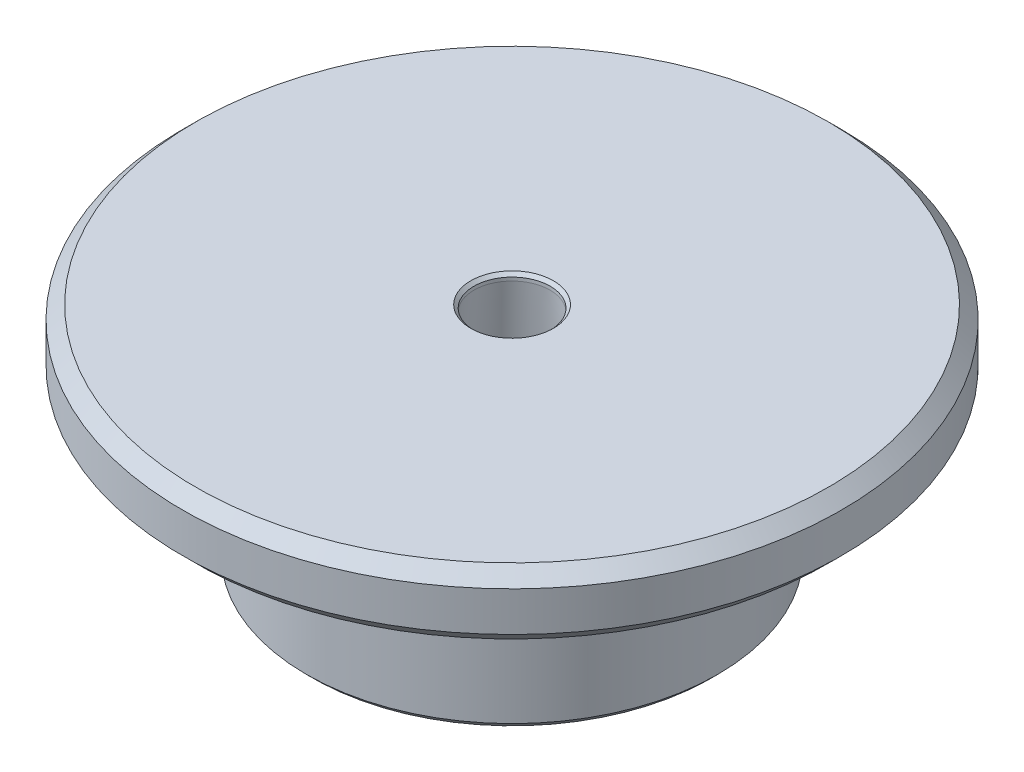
from build123d import *

# Parameters (mm, degrees)
CHAMFER1_SIZE = 1
CHAMFER2_SIZE = 0.24
CHAMFER3_SIZE = 1
CHAMFER4_SIZE = 0.5
FILLET1_R     = 5
FILLET2_R     = 0.25
FILLET3_R     = 0.25


with BuildPart() as part:
    # Sketch1 → Revolve1 (revolve)
    with BuildSketch(Plane.XY, mode=Mode.PRIVATE) as revolve1_sk:
        with BuildLine():
            Line((25, 0), (2.893789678, 0))
            Line((2.893789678, 0), (2.893789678, -0.5))
            Line((2.893789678, -0.5), (3.331232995, -5.5))
            Line((3.331232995, -5.5), (7.95, -5.5))
            Line((7.95, -5.5), (7.95, -15))
            Line((7.95, -15), (9.95, -15))
            Line((9.95, -15), (9.95, -1))
            Line((9.95, -1), (12.6, -1))
            Line((12.6, -1), (12.6, -14))
            Line((12.6, -14), (12.5, -14))
            ThreePointArc((12.5, -14), (12.159994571, -14.189295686), (12.141796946, -14.578018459))
            Line((12.141796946, -14.578018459), (12.6, -15.5))
            Line((12.6, -15.5), (12.6, -17))
            Line((12.6, -17), (15.6, -17))
            Line((15.6, -17), (15.6, -5))
            Line((15.6, -5), (25, -5))
            Line((25, -5), (25, 0))
        make_face()
    revolve(revolve1_sk.sketch.rotate(Axis((0, 0, 0), (0, 1, 0)), 90), axis=Axis((0, 0, 0), (0, 1, 0)))

    # Chamfer1
    chamfer1_edges = [part.edges().sort_by_distance(p)[0] for p in [
        (0, -5, 25),
        (0, 0, 25),
    ]]
    chamfer(chamfer1_edges, length=CHAMFER1_SIZE)

    # Chamfer2
    chamfer2_edges = [part.edges().sort_by_distance(p)[0] for p in [
        (0, 0, 2.893789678),
    ]]
    chamfer(chamfer2_edges, length=CHAMFER2_SIZE)

    # Chamfer3
    chamfer3_edges = [part.edges().sort_by_distance(p)[0] for p in [
        (0, -5.5, 7.95),
        (0, -1, 12.6),
    ]]
    chamfer(chamfer3_edges, length=CHAMFER3_SIZE)

    # Chamfer4
    chamfer4_edges = [part.edges().sort_by_distance(p)[0] for p in [
        (0, -17, 12.6),
        (0, -17, 15.6),
        (0, -15, 9.95),
    ]]
    chamfer(chamfer4_edges, length=CHAMFER4_SIZE)

    # Fillet1
    fillet1_edges = [part.edges().sort_by_distance(p)[0] for p in [
        (0, -5, 15.6),
    ]]
    fillet(fillet1_edges, radius=FILLET1_R)

    # Fillet2
    fillet2_edges = [part.edges().sort_by_distance(p)[0] for p in [
        (0, -5.5, 3.331232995),
        (0, -15, 7.95),
        (0, -1, 9.95),
    ]]
    fillet(fillet2_edges, radius=FILLET2_R)

    # Fillet3
    fillet3_edges = [part.edges().sort_by_distance(p)[0] for p in [
        (0, -14, 12.6),
    ]]
    fillet(fillet3_edges, radius=FILLET3_R)


solid = part.part
